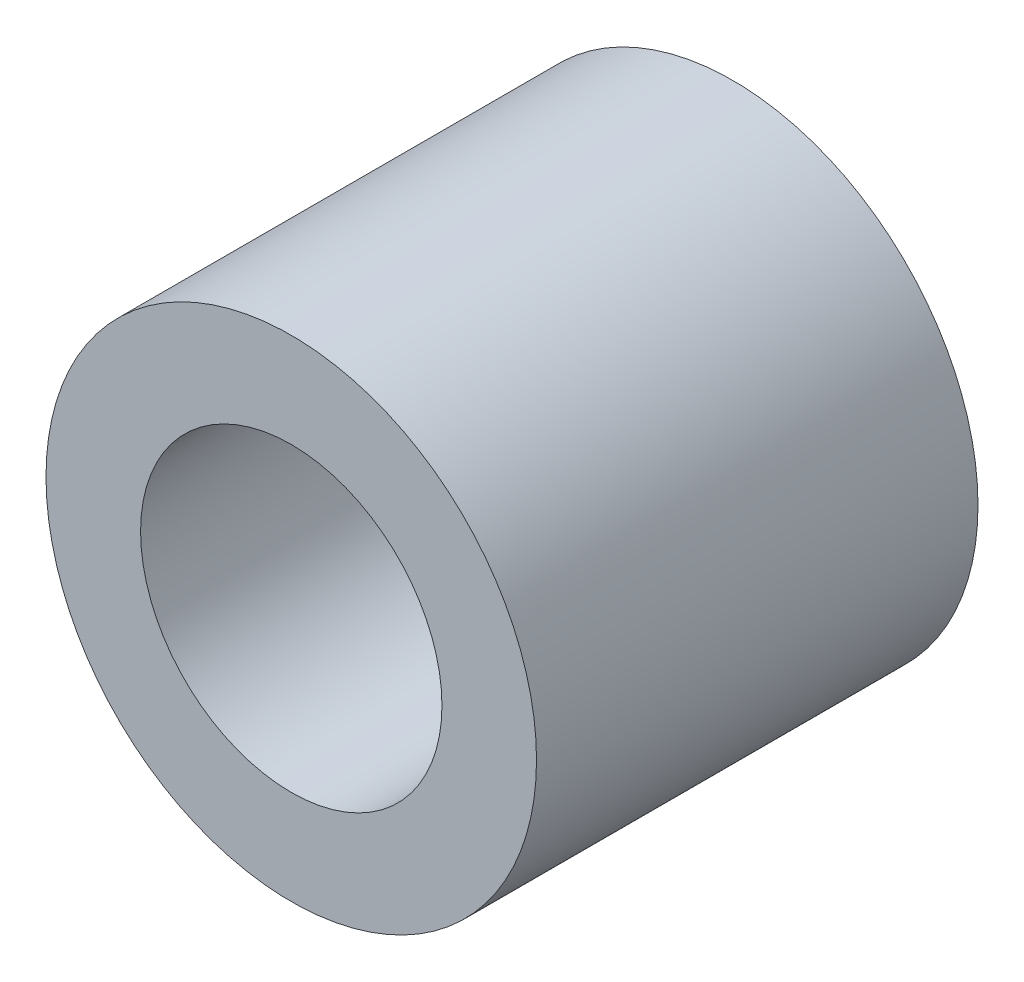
from build123d import *

# Parameters (mm, degrees)
SKETCH1_R      = 3.96875
SKETCH1_R_2    = 2.4384
EXTRUDE1_DEPTH = 3.571875


with BuildPart() as part:
    # Sketch1 → Extrude1 (new, symmetric)
    with BuildSketch(Plane.XY):
        Circle(SKETCH1_R)
        Circle(SKETCH1_R_2, mode=Mode.SUBTRACT)
    extrude(amount=EXTRUDE1_DEPTH, both=True)


solid = part.part
